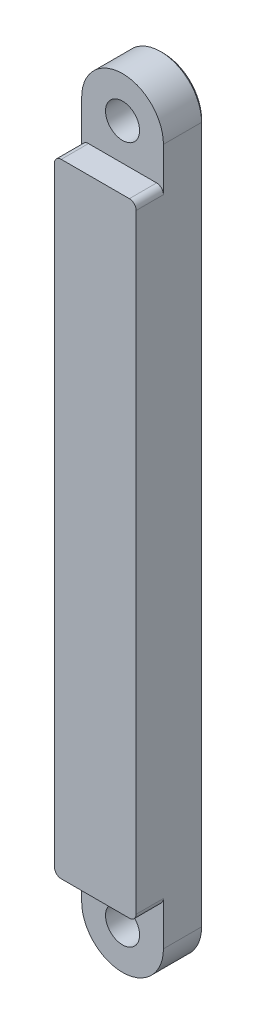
from build123d import *

# Parameters (mm, degrees)
SZKIC1_R                    = 1.25
DODANIE_WYCI_GNI_CIE1_DEPTH = 3
SZKIC2_W                    = 6
SZKIC2_H                    = 45.736788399
DODANIE_WYCI_GNI_CIE2_DEPTH = 2
ZAOKR_GLENIE1_R             = 0.5
SFAZOWANIE1_SIZE            = 0.2


with BuildPart() as part:
    # Szkic1 → Dodanie-wyci_gni_cie1 (new body)
    with BuildSketch(Plane.XY):
        with BuildLine():
            Line((-48.555714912, 47.677088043), (-48.555714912, -3.459700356))
            ThreePointArc((-48.555714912, -3.459700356), (-51.555714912, -6.459700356), (-54.555714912, -3.459700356))
            Line((-54.555714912, -3.459700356), (-54.555714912, 47.677088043))
            ThreePointArc((-54.555714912, 47.677088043), (-51.555714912, 50.677088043), (-48.555714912, 47.677088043))
        make_face()
        with Locations((-51.555714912, 47.677088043)):
            Circle(SZKIC1_R, mode=Mode.SUBTRACT)
        with Locations((-51.555714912, -3.459700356)):
            Circle(SZKIC1_R, mode=Mode.SUBTRACT)
    extrude(amount=DODANIE_WYCI_GNI_CIE1_DEPTH)

    # Szkic2 → Dodanie-wyci_gni_cie2 (add)
    with BuildSketch(Plane.XY.offset(3)):
        with Locations((-51.555714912, 22.108693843)):
            Rectangle(SZKIC2_W, SZKIC2_H)
    extrude(amount=DODANIE_WYCI_GNI_CIE2_DEPTH)

    # Zaokr_glenie1
    zaokr_glenie1_edges = [part.edges().sort_by_distance(p)[0] for p in [
        (-54.555714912, 44.977088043, 4),
        (-54.555714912, -0.759700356, 4),
        (-48.555714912, -0.759700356, 4),
        (-48.555714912, 44.977088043, 4),
    ]]
    fillet(zaokr_glenie1_edges, radius=ZAOKR_GLENIE1_R)

    # Sfazowanie1
    sfazowanie1_edges = [part.edges().sort_by_distance(p)[0] for p in [
        (-52.805714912, 47.677088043, 0),
        (-52.805714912, -3.459700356, 0),
        (-48.555714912, 22.108693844, 0),
        (-51.555714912, -6.459700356, 0),
        (-54.555714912, 22.108693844, 0),
        (-51.555714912, 50.677088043, 0),
    ]]
    chamfer(sfazowanie1_edges, length=SFAZOWANIE1_SIZE)


solid = part.part
